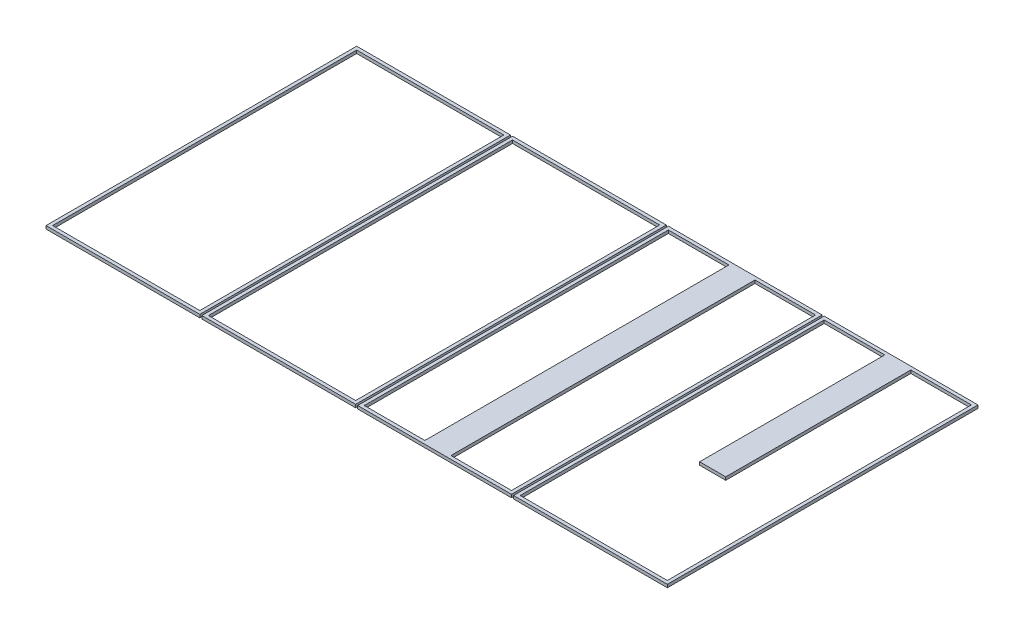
ISO-10303-21;
HEADER;
FILE_DESCRIPTION(('STEP AP214'),'2;1');
FILE_NAME('part.step','',(''),(''),'','','');
FILE_SCHEMA(('AUTOMOTIVE_DESIGN { 1 0 10303 214 1 1 1 1 }'));
ENDSEC;
DATA;
#1=APPLICATION_CONTEXT('core data for automotive mechanical design processes');
#2=APPLICATION_PROTOCOL_DEFINITION('international standard','automotive_design',2000,#1);
#3=PRODUCT_CONTEXT('',#1,'mechanical');
#4=PRODUCT('Part','Part','',(#3));
#5=PRODUCT_RELATED_PRODUCT_CATEGORY('part','',(#4));
#6=PRODUCT_DEFINITION_FORMATION('','',#4);
#7=PRODUCT_DEFINITION_CONTEXT('part definition',#1,'design');
#8=PRODUCT_DEFINITION('design','',#6,#7);
#9=PRODUCT_DEFINITION_SHAPE('','',#8);
#10=(LENGTH_UNIT() NAMED_UNIT(*) SI_UNIT(.MILLI.,.METRE.));
#11=(NAMED_UNIT(*) PLANE_ANGLE_UNIT() SI_UNIT($,.RADIAN.));
#12=(NAMED_UNIT(*) SI_UNIT($,.STERADIAN.) SOLID_ANGLE_UNIT());
#13=UNCERTAINTY_MEASURE_WITH_UNIT(LENGTH_MEASURE(1.E-05),#10,'distance_accuracy_value','');
#14=(GEOMETRIC_REPRESENTATION_CONTEXT(3) GLOBAL_UNCERTAINTY_ASSIGNED_CONTEXT((#13)) GLOBAL_UNIT_ASSIGNED_CONTEXT((#10,
#11,#12)) REPRESENTATION_CONTEXT('',''));
#15=CARTESIAN_POINT('',(0.,0.,0.));
#16=DIRECTION('',(0.,0.,1.));
#17=DIRECTION('',(1.,0.,0.));
#18=AXIS2_PLACEMENT_3D('',#15,#16,#17);
#19=CARTESIAN_POINT('',(1237.,12.,-13.));
#20=DIRECTION('',(0.,0.,-1.));
#21=DIRECTION('',(-1.,0.,0.));
#22=AXIS2_PLACEMENT_3D('',#19,#20,#21);
#23=PLANE('',#22);
#24=DIRECTION('',(1.,0.,0.));
#25=VECTOR('',#24,1.);
#26=CARTESIAN_POINT('',(1237.,12.,-13.));
#27=LINE('',#26,#25);
#28=CARTESIAN_POINT('',(1237.,12.,-13.));
#29=VERTEX_POINT('',#28);
#30=CARTESIAN_POINT('',(1474.8,12.,-13.));
#31=VERTEX_POINT('',#30);
#32=EDGE_CURVE('E137',#29,#31,#27,.T.);
#33=ORIENTED_EDGE('',*,*,#32,.T.);
#34=DIRECTION('',(0.,-1.,0.));
#35=VECTOR('',#34,1.);
#36=CARTESIAN_POINT('',(1474.8,12.,-13.));
#37=LINE('',#36,#35);
#38=CARTESIAN_POINT('',(1474.8,0.,-13.));
#39=VERTEX_POINT('',#38);
#40=EDGE_CURVE('E144',#31,#39,#37,.T.);
#41=ORIENTED_EDGE('',*,*,#40,.T.);
#42=DIRECTION('',(1.,0.,0.));
#43=VECTOR('',#42,1.);
#44=CARTESIAN_POINT('',(1237.,0.,-13.));
#45=LINE('',#44,#43);
#46=CARTESIAN_POINT('',(1237.,0.,-13.));
#47=VERTEX_POINT('',#46);
#48=EDGE_CURVE('E168',#47,#39,#45,.T.);
#49=ORIENTED_EDGE('',*,*,#48,.F.);
#50=DIRECTION('',(0.,-1.,0.));
#51=VECTOR('',#50,1.);
#52=CARTESIAN_POINT('',(1237.,12.,-13.));
#53=LINE('',#52,#51);
#54=EDGE_CURVE('E152',#29,#47,#53,.T.);
#55=ORIENTED_EDGE('',*,*,#54,.F.);
#56=EDGE_LOOP('',(#33,#41,#49,#55));
#57=FACE_BOUND('',#56,.T.);
#58=ADVANCED_FACE('F43',(#57),#23,.T.);
#59=CARTESIAN_POINT('',(1577.2,0.,-13.));
#60=VERTEX_POINT('',#59);
#61=CARTESIAN_POINT('',(1815.,0.,-13.));
#62=VERTEX_POINT('',#61);
#63=EDGE_CURVE('E167',#60,#62,#45,.T.);
#64=ORIENTED_EDGE('',*,*,#63,.F.);
#65=DIRECTION('',(0.,-1.,0.));
#66=VECTOR('',#65,1.);
#67=CARTESIAN_POINT('',(1577.2,12.,-12.9999999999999));
#68=LINE('',#67,#66);
#69=CARTESIAN_POINT('',(1577.2,12.,-12.9999999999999));
#70=VERTEX_POINT('',#69);
#71=EDGE_CURVE('E148',#70,#60,#68,.T.);
#72=ORIENTED_EDGE('',*,*,#71,.F.);
#73=CARTESIAN_POINT('',(1815.,12.,-13.));
#74=VERTEX_POINT('',#73);
#75=EDGE_CURVE('E154',#70,#74,#27,.T.);
#76=ORIENTED_EDGE('',*,*,#75,.T.);
#77=DIRECTION('',(0.,-1.,0.));
#78=VECTOR('',#77,1.);
#79=CARTESIAN_POINT('',(1815.,12.,-13.));
#80=LINE('',#79,#78);
#81=EDGE_CURVE('E180',#74,#62,#80,.T.);
#82=ORIENTED_EDGE('',*,*,#81,.T.);
#83=EDGE_LOOP('',(#64,#72,#76,#82));
#84=FACE_BOUND('',#83,.T.);
#85=ADVANCED_FACE('F235',(#84),#23,.T.);
#86=CARTESIAN_POINT('',(1237.,12.,-1207.));
#87=DIRECTION('',(0.,0.,1.));
#88=DIRECTION('',(1.,0.,0.));
#89=AXIS2_PLACEMENT_3D('',#86,#87,#88);
#90=PLANE('',#89);
#91=DIRECTION('',(-1.,0.,0.));
#92=VECTOR('',#91,1.);
#93=CARTESIAN_POINT('',(1237.,0.,-1207.));
#94=LINE('',#93,#92);
#95=CARTESIAN_POINT('',(1474.8,0.,-1207.));
#96=VERTEX_POINT('',#95);
#97=CARTESIAN_POINT('',(1237.,0.,-1207.));
#98=VERTEX_POINT('',#97);
#99=EDGE_CURVE('E173',#96,#98,#94,.T.);
#100=ORIENTED_EDGE('',*,*,#99,.F.);
#101=DIRECTION('',(0.,-1.,0.));
#102=VECTOR('',#101,1.);
#103=CARTESIAN_POINT('',(1474.8,12.,-1207.));
#104=LINE('',#103,#102);
#105=CARTESIAN_POINT('',(1474.8,12.,-1207.));
#106=VERTEX_POINT('',#105);
#107=EDGE_CURVE('E296',#106,#96,#104,.T.);
#108=ORIENTED_EDGE('',*,*,#107,.F.);
#109=DIRECTION('',(-1.,0.,0.));
#110=VECTOR('',#109,1.);
#111=CARTESIAN_POINT('',(1237.,12.,-1207.));
#112=LINE('',#111,#110);
#113=CARTESIAN_POINT('',(1237.,12.,-1207.));
#114=VERTEX_POINT('',#113);
#115=EDGE_CURVE('E138',#106,#114,#112,.T.);
#116=ORIENTED_EDGE('',*,*,#115,.T.);
#117=DIRECTION('',(0.,-1.,0.));
#118=VECTOR('',#117,1.);
#119=CARTESIAN_POINT('',(1237.,12.,-1207.));
#120=LINE('',#119,#118);
#121=EDGE_CURVE('E164',#114,#98,#120,.T.);
#122=ORIENTED_EDGE('',*,*,#121,.T.);
#123=EDGE_LOOP('',(#100,#108,#116,#122));
#124=FACE_BOUND('',#123,.T.);
#125=ADVANCED_FACE('F240',(#124),#90,.T.);
#126=CARTESIAN_POINT('',(1815.,12.,-1207.));
#127=VERTEX_POINT('',#126);
#128=CARTESIAN_POINT('',(1577.2,12.,-1207.));
#129=VERTEX_POINT('',#128);
#130=EDGE_CURVE('E161',#127,#129,#112,.T.);
#131=ORIENTED_EDGE('',*,*,#130,.T.);
#132=DIRECTION('',(0.,-1.,0.));
#133=VECTOR('',#132,1.);
#134=CARTESIAN_POINT('',(1577.2,12.,-1207.));
#135=LINE('',#134,#133);
#136=CARTESIAN_POINT('',(1577.2,0.,-1207.));
#137=VERTEX_POINT('',#136);
#138=EDGE_CURVE('E299',#129,#137,#135,.T.);
#139=ORIENTED_EDGE('',*,*,#138,.T.);
#140=CARTESIAN_POINT('',(1815.,0.,-1207.));
#141=VERTEX_POINT('',#140);
#142=EDGE_CURVE('E174',#141,#137,#94,.T.);
#143=ORIENTED_EDGE('',*,*,#142,.F.);
#144=DIRECTION('',(0.,-1.,0.));
#145=VECTOR('',#144,1.);
#146=CARTESIAN_POINT('',(1815.,12.,-1207.));
#147=LINE('',#146,#145);
#148=EDGE_CURVE('E178',#127,#141,#147,.T.);
#149=ORIENTED_EDGE('',*,*,#148,.F.);
#150=EDGE_LOOP('',(#131,#139,#143,#149));
#151=FACE_BOUND('',#150,.T.);
#152=ADVANCED_FACE('F252',(#151),#90,.T.);
#153=CARTESIAN_POINT('',(0.,12.,0.));
#154=DIRECTION('',(0.,1.,0.));
#155=DIRECTION('',(0.,0.,1.));
#156=AXIS2_PLACEMENT_3D('',#153,#154,#155);
#157=PLANE('',#156);
#158=ORIENTED_EDGE('',*,*,#75,.F.);
#159=DIRECTION('',(0.,0.,-1.));
#160=VECTOR('',#159,1.);
#161=CARTESIAN_POINT('',(1577.2,12.,-1207.));
#162=LINE('',#161,#160);
#163=EDGE_CURVE('E141',#70,#129,#162,.T.);
#164=ORIENTED_EDGE('',*,*,#163,.T.);
#165=ORIENTED_EDGE('',*,*,#130,.F.);
#166=DIRECTION('',(0.,0.,-1.));
#167=VECTOR('',#166,1.);
#168=CARTESIAN_POINT('',(1815.,12.,-13.));
#169=LINE('',#168,#167);
#170=EDGE_CURVE('E153',#74,#127,#169,.T.);
#171=ORIENTED_EDGE('',*,*,#170,.F.);
#172=EDGE_LOOP('',(#158,#164,#165,#171));
#173=FACE_BOUND('',#172,.T.);
#174=DIRECTION('',(1.,0.,0.));
#175=VECTOR('',#174,1.);
#176=CARTESIAN_POINT('',(1224.,12.,0.));
#177=LINE('',#176,#175);
#178=CARTESIAN_POINT('',(1224.,12.,0.));
#179=VERTEX_POINT('',#178);
#180=CARTESIAN_POINT('',(1828.,12.,0.));
#181=VERTEX_POINT('',#180);
#182=EDGE_CURVE('E185',#179,#181,#177,.T.);
#183=ORIENTED_EDGE('',*,*,#182,.T.);
#184=DIRECTION('',(0.,0.,-1.));
#185=VECTOR('',#184,1.);
#186=CARTESIAN_POINT('',(1828.,12.,0.));
#187=LINE('',#186,#185);
#188=CARTESIAN_POINT('',(1828.,12.,-1220.));
#189=VERTEX_POINT('',#188);
#190=EDGE_CURVE('E187',#181,#189,#187,.T.);
#191=ORIENTED_EDGE('',*,*,#190,.T.);
#192=DIRECTION('',(-1.,0.,0.));
#193=VECTOR('',#192,1.);
#194=CARTESIAN_POINT('',(1224.,12.,-1220.));
#195=LINE('',#194,#193);
#196=CARTESIAN_POINT('',(1224.,12.,-1220.));
#197=VERTEX_POINT('',#196);
#198=EDGE_CURVE('E190',#189,#197,#195,.T.);
#199=ORIENTED_EDGE('',*,*,#198,.T.);
#200=DIRECTION('',(0.,0.,1.));
#201=VECTOR('',#200,1.);
#202=CARTESIAN_POINT('',(1224.,12.,0.));
#203=LINE('',#202,#201);
#204=EDGE_CURVE('E192',#197,#179,#203,.T.);
#205=ORIENTED_EDGE('',*,*,#204,.T.);
#206=EDGE_LOOP('',(#183,#191,#199,#205));
#207=FACE_BOUND('',#206,.T.);
#208=ORIENTED_EDGE('',*,*,#32,.F.);
#209=DIRECTION('',(0.,0.,1.));
#210=VECTOR('',#209,1.);
#211=CARTESIAN_POINT('',(1237.,12.,-13.));
#212=LINE('',#211,#210);
#213=EDGE_CURVE('E158',#114,#29,#212,.T.);
#214=ORIENTED_EDGE('',*,*,#213,.F.);
#215=ORIENTED_EDGE('',*,*,#115,.F.);
#216=DIRECTION('',(0.,0.,1.));
#217=VECTOR('',#216,1.);
#218=CARTESIAN_POINT('',(1474.8,12.,-1207.));
#219=LINE('',#218,#217);
#220=EDGE_CURVE('E132',#106,#31,#219,.T.);
#221=ORIENTED_EDGE('',*,*,#220,.T.);
#222=EDGE_LOOP('',(#208,#214,#215,#221));
#223=FACE_BOUND('',#222,.T.);
#224=ADVANCED_FACE('F134',(#173,#207,#223),#157,.T.);
#225=CARTESIAN_POINT('',(0.,0.,0.));
#226=DIRECTION('',(0.,1.,0.));
#227=DIRECTION('',(0.,0.,1.));
#228=AXIS2_PLACEMENT_3D('',#225,#226,#227);
#229=PLANE('',#228);
#230=DIRECTION('',(0.,0.,-1.));
#231=VECTOR('',#230,1.);
#232=CARTESIAN_POINT('',(1577.2,0.,-1207.));
#233=LINE('',#232,#231);
#234=EDGE_CURVE('E58',#60,#137,#233,.T.);
#235=ORIENTED_EDGE('',*,*,#234,.F.);
#236=ORIENTED_EDGE('',*,*,#63,.T.);
#237=DIRECTION('',(0.,0.,-1.));
#238=VECTOR('',#237,1.);
#239=CARTESIAN_POINT('',(1815.,0.,-13.));
#240=LINE('',#239,#238);
#241=EDGE_CURVE('E170',#62,#141,#240,.T.);
#242=ORIENTED_EDGE('',*,*,#241,.T.);
#243=ORIENTED_EDGE('',*,*,#142,.T.);
#244=EDGE_LOOP('',(#235,#236,#242,#243));
#245=FACE_BOUND('',#244,.T.);
#246=DIRECTION('',(1.,0.,0.));
#247=VECTOR('',#246,1.);
#248=CARTESIAN_POINT('',(1815.,0.,0.));
#249=LINE('',#248,#247);
#250=CARTESIAN_POINT('',(1224.,0.,0.));
#251=VERTEX_POINT('',#250);
#252=CARTESIAN_POINT('',(1828.,0.,0.));
#253=VERTEX_POINT('',#252);
#254=EDGE_CURVE('E184',#251,#253,#249,.T.);
#255=ORIENTED_EDGE('',*,*,#254,.F.);
#256=DIRECTION('',(0.,0.,1.));
#257=VECTOR('',#256,1.);
#258=CARTESIAN_POINT('',(1224.,0.,0.));
#259=LINE('',#258,#257);
#260=CARTESIAN_POINT('',(1224.,0.,-1220.));
#261=VERTEX_POINT('',#260);
#262=EDGE_CURVE('E188',#261,#251,#259,.T.);
#263=ORIENTED_EDGE('',*,*,#262,.F.);
#264=DIRECTION('',(-1.,0.,0.));
#265=VECTOR('',#264,1.);
#266=CARTESIAN_POINT('',(1224.,0.,-1220.));
#267=LINE('',#266,#265);
#268=CARTESIAN_POINT('',(1828.,0.,-1220.));
#269=VERTEX_POINT('',#268);
#270=EDGE_CURVE('E198',#269,#261,#267,.T.);
#271=ORIENTED_EDGE('',*,*,#270,.F.);
#272=DIRECTION('',(0.,0.,-1.));
#273=VECTOR('',#272,1.);
#274=CARTESIAN_POINT('',(1828.,0.,0.));
#275=LINE('',#274,#273);
#276=EDGE_CURVE('E196',#253,#269,#275,.T.);
#277=ORIENTED_EDGE('',*,*,#276,.F.);
#278=EDGE_LOOP('',(#255,#263,#271,#277));
#279=FACE_BOUND('',#278,.T.);
#280=DIRECTION('',(0.,0.,1.));
#281=VECTOR('',#280,1.);
#282=CARTESIAN_POINT('',(1237.,0.,-13.));
#283=LINE('',#282,#281);
#284=EDGE_CURVE('E147',#98,#47,#283,.T.);
#285=ORIENTED_EDGE('',*,*,#284,.T.);
#286=ORIENTED_EDGE('',*,*,#48,.T.);
#287=DIRECTION('',(0.,0.,1.));
#288=VECTOR('',#287,1.);
#289=CARTESIAN_POINT('',(1474.8,0.,-1207.));
#290=LINE('',#289,#288);
#291=EDGE_CURVE('E66',#96,#39,#290,.T.);
#292=ORIENTED_EDGE('',*,*,#291,.F.);
#293=ORIENTED_EDGE('',*,*,#99,.T.);
#294=EDGE_LOOP('',(#285,#286,#292,#293));
#295=FACE_BOUND('',#294,.T.);
#296=ADVANCED_FACE('F218',(#245,#279,#295),#229,.F.);
#297=CARTESIAN_POINT('',(1815.,12.,0.));
#298=DIRECTION('',(0.,0.,-1.));
#299=DIRECTION('',(-1.,0.,0.));
#300=AXIS2_PLACEMENT_3D('',#297,#298,#299);
#301=PLANE('',#300);
#302=ORIENTED_EDGE('',*,*,#254,.T.);
#303=DIRECTION('',(0.,-1.,0.));
#304=VECTOR('',#303,1.);
#305=CARTESIAN_POINT('',(1828.,12.,0.));
#306=LINE('',#305,#304);
#307=EDGE_CURVE('E12',#181,#253,#306,.T.);
#308=ORIENTED_EDGE('',*,*,#307,.F.);
#309=ORIENTED_EDGE('',*,*,#182,.F.);
#310=DIRECTION('',(0.,-1.,0.));
#311=VECTOR('',#310,1.);
#312=CARTESIAN_POINT('',(1224.,12.,0.));
#313=LINE('',#312,#311);
#314=EDGE_CURVE('E194',#179,#251,#313,.T.);
#315=ORIENTED_EDGE('',*,*,#314,.T.);
#316=EDGE_LOOP('',(#302,#308,#309,#315));
#317=FACE_BOUND('',#316,.T.);
#318=ADVANCED_FACE('F45',(#317),#301,.F.);
#319=CARTESIAN_POINT('',(1828.,12.,0.));
#320=DIRECTION('',(-1.,0.,0.));
#321=DIRECTION('',(0.,0.,1.));
#322=AXIS2_PLACEMENT_3D('',#319,#320,#321);
#323=PLANE('',#322);
#324=ORIENTED_EDGE('',*,*,#276,.T.);
#325=DIRECTION('',(0.,-1.,0.));
#326=VECTOR('',#325,1.);
#327=CARTESIAN_POINT('',(1828.,12.,-1220.));
#328=LINE('',#327,#326);
#329=EDGE_CURVE('E51',#189,#269,#328,.T.);
#330=ORIENTED_EDGE('',*,*,#329,.F.);
#331=ORIENTED_EDGE('',*,*,#190,.F.);
#332=ORIENTED_EDGE('',*,*,#307,.T.);
#333=EDGE_LOOP('',(#324,#330,#331,#332));
#334=FACE_BOUND('',#333,.T.);
#335=ADVANCED_FACE('F227',(#334),#323,.F.);
#336=CARTESIAN_POINT('',(1224.,12.,-1220.));
#337=DIRECTION('',(0.,0.,1.));
#338=DIRECTION('',(1.,0.,0.));
#339=AXIS2_PLACEMENT_3D('',#336,#337,#338);
#340=PLANE('',#339);
#341=ORIENTED_EDGE('',*,*,#270,.T.);
#342=DIRECTION('',(0.,-1.,0.));
#343=VECTOR('',#342,1.);
#344=CARTESIAN_POINT('',(1224.,12.,-1220.));
#345=LINE('',#344,#343);
#346=EDGE_CURVE('E204',#197,#261,#345,.T.);
#347=ORIENTED_EDGE('',*,*,#346,.F.);
#348=ORIENTED_EDGE('',*,*,#198,.F.);
#349=ORIENTED_EDGE('',*,*,#329,.T.);
#350=EDGE_LOOP('',(#341,#347,#348,#349));
#351=FACE_BOUND('',#350,.T.);
#352=ADVANCED_FACE('F211',(#351),#340,.F.);
#353=CARTESIAN_POINT('',(1224.,12.,0.));
#354=DIRECTION('',(1.,0.,0.));
#355=DIRECTION('',(0.,0.,-1.));
#356=AXIS2_PLACEMENT_3D('',#353,#354,#355);
#357=PLANE('',#356);
#358=ORIENTED_EDGE('',*,*,#262,.T.);
#359=ORIENTED_EDGE('',*,*,#314,.F.);
#360=ORIENTED_EDGE('',*,*,#204,.F.);
#361=ORIENTED_EDGE('',*,*,#346,.T.);
#362=EDGE_LOOP('',(#358,#359,#360,#361));
#363=FACE_BOUND('',#362,.T.);
#364=ADVANCED_FACE('F221',(#363),#357,.F.);
#365=CARTESIAN_POINT('',(1237.,12.,-13.));
#366=DIRECTION('',(1.,0.,0.));
#367=DIRECTION('',(0.,0.,-1.));
#368=AXIS2_PLACEMENT_3D('',#365,#366,#367);
#369=PLANE('',#368);
#370=ORIENTED_EDGE('',*,*,#284,.F.);
#371=ORIENTED_EDGE('',*,*,#121,.F.);
#372=ORIENTED_EDGE('',*,*,#213,.T.);
#373=ORIENTED_EDGE('',*,*,#54,.T.);
#374=EDGE_LOOP('',(#370,#371,#372,#373));
#375=FACE_BOUND('',#374,.T.);
#376=ADVANCED_FACE('F246',(#375),#369,.T.);
#377=CARTESIAN_POINT('',(1815.,12.,-13.));
#378=DIRECTION('',(-1.,0.,0.));
#379=DIRECTION('',(0.,0.,1.));
#380=AXIS2_PLACEMENT_3D('',#377,#378,#379);
#381=PLANE('',#380);
#382=ORIENTED_EDGE('',*,*,#241,.F.);
#383=ORIENTED_EDGE('',*,*,#81,.F.);
#384=ORIENTED_EDGE('',*,*,#170,.T.);
#385=ORIENTED_EDGE('',*,*,#148,.T.);
#386=EDGE_LOOP('',(#382,#383,#384,#385));
#387=FACE_BOUND('',#386,.T.);
#388=ADVANCED_FACE('F244',(#387),#381,.T.);
#389=CARTESIAN_POINT('',(1474.8,12.,-1207.));
#390=DIRECTION('',(1.,0.,0.));
#391=DIRECTION('',(0.,0.,-1.));
#392=AXIS2_PLACEMENT_3D('',#389,#390,#391);
#393=PLANE('',#392);
#394=ORIENTED_EDGE('',*,*,#291,.T.);
#395=ORIENTED_EDGE('',*,*,#40,.F.);
#396=ORIENTED_EDGE('',*,*,#220,.F.);
#397=ORIENTED_EDGE('',*,*,#107,.T.);
#398=EDGE_LOOP('',(#394,#395,#396,#397));
#399=FACE_BOUND('',#398,.T.);
#400=ADVANCED_FACE('F145',(#399),#393,.F.);
#401=CARTESIAN_POINT('',(1577.2,12.,-1207.));
#402=DIRECTION('',(-1.,0.,0.));
#403=DIRECTION('',(0.,0.,1.));
#404=AXIS2_PLACEMENT_3D('',#401,#402,#403);
#405=PLANE('',#404);
#406=ORIENTED_EDGE('',*,*,#234,.T.);
#407=ORIENTED_EDGE('',*,*,#138,.F.);
#408=ORIENTED_EDGE('',*,*,#163,.F.);
#409=ORIENTED_EDGE('',*,*,#71,.T.);
#410=EDGE_LOOP('',(#406,#407,#408,#409));
#411=FACE_BOUND('',#410,.T.);
#412=ADVANCED_FACE('F278',(#411),#405,.F.);
#413=CLOSED_SHELL('',(#58,#85,#125,#152,#224,#296,#318,#335,#352,#364,#376,#388,#400,#412));
#414=MANIFOLD_SOLID_BREP('B2',#413);
#415=CARTESIAN_POINT('',(0.,12.,0.));
#416=DIRECTION('',(0.,1.,0.));
#417=DIRECTION('',(0.,0.,1.));
#418=AXIS2_PLACEMENT_3D('',#415,#416,#417);
#419=PLANE('',#418);
#420=DIRECTION('',(1.,0.,0.));
#421=VECTOR('',#420,1.);
#422=CARTESIAN_POINT('',(612.,12.,0.));
#423=LINE('',#422,#421);
#424=CARTESIAN_POINT('',(612.,12.,0.));
#425=VERTEX_POINT('',#424);
#426=CARTESIAN_POINT('',(1216.,12.,0.));
#427=VERTEX_POINT('',#426);
#428=EDGE_CURVE('E467',#425,#427,#423,.T.);
#429=ORIENTED_EDGE('',*,*,#428,.T.);
#430=DIRECTION('',(0.,0.,-1.));
#431=VECTOR('',#430,1.);
#432=CARTESIAN_POINT('',(1216.,12.,0.));
#433=LINE('',#432,#431);
#434=CARTESIAN_POINT('',(1216.,12.,-1220.));
#435=VERTEX_POINT('',#434);
#436=EDGE_CURVE('E469',#427,#435,#433,.T.);
#437=ORIENTED_EDGE('',*,*,#436,.T.);
#438=DIRECTION('',(-1.,0.,0.));
#439=VECTOR('',#438,1.);
#440=CARTESIAN_POINT('',(612.,12.,-1220.));
#441=LINE('',#440,#439);
#442=CARTESIAN_POINT('',(612.,12.,-1220.));
#443=VERTEX_POINT('',#442);
#444=EDGE_CURVE('E472',#435,#443,#441,.T.);
#445=ORIENTED_EDGE('',*,*,#444,.T.);
#446=DIRECTION('',(0.,0.,1.));
#447=VECTOR('',#446,1.);
#448=CARTESIAN_POINT('',(612.,12.,0.));
#449=LINE('',#448,#447);
#450=EDGE_CURVE('E474',#443,#425,#449,.T.);
#451=ORIENTED_EDGE('',*,*,#450,.T.);
#452=EDGE_LOOP('',(#429,#437,#445,#451));
#453=FACE_BOUND('',#452,.T.);
#454=DIRECTION('',(1.,0.,0.));
#455=VECTOR('',#454,1.);
#456=CARTESIAN_POINT('',(625.,12.,-13.));
#457=LINE('',#456,#455);
#458=CARTESIAN_POINT('',(625.,12.,-13.));
#459=VERTEX_POINT('',#458);
#460=CARTESIAN_POINT('',(1203.,12.,-13.));
#461=VERTEX_POINT('',#460);
#462=EDGE_CURVE('E439',#459,#461,#457,.T.);
#463=ORIENTED_EDGE('',*,*,#462,.F.);
#464=DIRECTION('',(0.,0.,1.));
#465=VECTOR('',#464,1.);
#466=CARTESIAN_POINT('',(625.,12.,-1207.));
#467=LINE('',#466,#465);
#468=CARTESIAN_POINT('',(625.,12.,-1207.));
#469=VERTEX_POINT('',#468);
#470=EDGE_CURVE('E431',#469,#459,#467,.T.);
#471=ORIENTED_EDGE('',*,*,#470,.F.);
#472=DIRECTION('',(-1.,0.,0.));
#473=VECTOR('',#472,1.);
#474=CARTESIAN_POINT('',(625.,12.,-1207.));
#475=LINE('',#474,#473);
#476=CARTESIAN_POINT('',(1203.,12.,-1207.));
#477=VERTEX_POINT('',#476);
#478=EDGE_CURVE('E453',#477,#469,#475,.T.);
#479=ORIENTED_EDGE('',*,*,#478,.F.);
#480=DIRECTION('',(0.,0.,-1.));
#481=VECTOR('',#480,1.);
#482=CARTESIAN_POINT('',(1203.,12.,-1207.));
#483=LINE('',#482,#481);
#484=EDGE_CURVE('E451',#461,#477,#483,.T.);
#485=ORIENTED_EDGE('',*,*,#484,.F.);
#486=EDGE_LOOP('',(#463,#471,#479,#485));
#487=FACE_BOUND('',#486,.T.);
#488=ADVANCED_FACE('F366',(#453,#487),#419,.T.);
#489=CARTESIAN_POINT('',(0.,0.,0.));
#490=DIRECTION('',(0.,1.,0.));
#491=DIRECTION('',(0.,0.,1.));
#492=AXIS2_PLACEMENT_3D('',#489,#490,#491);
#493=PLANE('',#492);
#494=DIRECTION('',(1.,0.,0.));
#495=VECTOR('',#494,1.);
#496=CARTESIAN_POINT('',(1203.,0.,0.));
#497=LINE('',#496,#495);
#498=CARTESIAN_POINT('',(612.,0.,0.));
#499=VERTEX_POINT('',#498);
#500=CARTESIAN_POINT('',(1216.,0.,0.));
#501=VERTEX_POINT('',#500);
#502=EDGE_CURVE('E447',#499,#501,#497,.T.);
#503=ORIENTED_EDGE('',*,*,#502,.F.);
#504=DIRECTION('',(0.,0.,1.));
#505=VECTOR('',#504,1.);
#506=CARTESIAN_POINT('',(612.,0.,0.));
#507=LINE('',#506,#505);
#508=CARTESIAN_POINT('',(612.,0.,-1220.));
#509=VERTEX_POINT('',#508);
#510=EDGE_CURVE('E470',#509,#499,#507,.T.);
#511=ORIENTED_EDGE('',*,*,#510,.F.);
#512=DIRECTION('',(-1.,0.,0.));
#513=VECTOR('',#512,1.);
#514=CARTESIAN_POINT('',(612.,0.,-1220.));
#515=LINE('',#514,#513);
#516=CARTESIAN_POINT('',(1216.,0.,-1220.));
#517=VERTEX_POINT('',#516);
#518=EDGE_CURVE('E480',#517,#509,#515,.T.);
#519=ORIENTED_EDGE('',*,*,#518,.F.);
#520=DIRECTION('',(0.,0.,-1.));
#521=VECTOR('',#520,1.);
#522=CARTESIAN_POINT('',(1216.,0.,0.));
#523=LINE('',#522,#521);
#524=EDGE_CURVE('E478',#501,#517,#523,.T.);
#525=ORIENTED_EDGE('',*,*,#524,.F.);
#526=EDGE_LOOP('',(#503,#511,#519,#525));
#527=FACE_BOUND('',#526,.T.);
#528=DIRECTION('',(0.,0.,1.));
#529=VECTOR('',#528,1.);
#530=CARTESIAN_POINT('',(625.,0.,-1207.));
#531=LINE('',#530,#529);
#532=CARTESIAN_POINT('',(625.,0.,-1207.));
#533=VERTEX_POINT('',#532);
#534=CARTESIAN_POINT('',(625.,0.,-13.));
#535=VERTEX_POINT('',#534);
#536=EDGE_CURVE('E389',#533,#535,#531,.T.);
#537=ORIENTED_EDGE('',*,*,#536,.T.);
#538=DIRECTION('',(1.,0.,0.));
#539=VECTOR('',#538,1.);
#540=CARTESIAN_POINT('',(625.,0.,-13.));
#541=LINE('',#540,#539);
#542=CARTESIAN_POINT('',(1203.,0.,-13.));
#543=VERTEX_POINT('',#542);
#544=EDGE_CURVE('E446',#535,#543,#541,.T.);
#545=ORIENTED_EDGE('',*,*,#544,.T.);
#546=DIRECTION('',(0.,0.,-1.));
#547=VECTOR('',#546,1.);
#548=CARTESIAN_POINT('',(1203.,0.,-1207.));
#549=LINE('',#548,#547);
#550=CARTESIAN_POINT('',(1203.,0.,-1207.));
#551=VERTEX_POINT('',#550);
#552=EDGE_CURVE('E459',#543,#551,#549,.T.);
#553=ORIENTED_EDGE('',*,*,#552,.T.);
#554=DIRECTION('',(-1.,0.,0.));
#555=VECTOR('',#554,1.);
#556=CARTESIAN_POINT('',(625.,0.,-1207.));
#557=LINE('',#556,#555);
#558=EDGE_CURVE('E440',#551,#533,#557,.T.);
#559=ORIENTED_EDGE('',*,*,#558,.T.);
#560=EDGE_LOOP('',(#537,#545,#553,#559));
#561=FACE_BOUND('',#560,.T.);
#562=ADVANCED_FACE('F500',(#527,#561),#493,.F.);
#563=CARTESIAN_POINT('',(1203.,12.,0.));
#564=DIRECTION('',(0.,0.,-1.));
#565=DIRECTION('',(-1.,0.,0.));
#566=AXIS2_PLACEMENT_3D('',#563,#564,#565);
#567=PLANE('',#566);
#568=ORIENTED_EDGE('',*,*,#502,.T.);
#569=DIRECTION('',(0.,-1.,0.));
#570=VECTOR('',#569,1.);
#571=CARTESIAN_POINT('',(1216.,12.,0.));
#572=LINE('',#571,#570);
#573=EDGE_CURVE('E41',#427,#501,#572,.T.);
#574=ORIENTED_EDGE('',*,*,#573,.F.);
#575=ORIENTED_EDGE('',*,*,#428,.F.);
#576=DIRECTION('',(0.,-1.,0.));
#577=VECTOR('',#576,1.);
#578=CARTESIAN_POINT('',(612.,12.,0.));
#579=LINE('',#578,#577);
#580=EDGE_CURVE('E476',#425,#499,#579,.T.);
#581=ORIENTED_EDGE('',*,*,#580,.T.);
#582=EDGE_LOOP('',(#568,#574,#575,#581));
#583=FACE_BOUND('',#582,.T.);
#584=ADVANCED_FACE('F368',(#583),#567,.F.);
#585=CARTESIAN_POINT('',(1216.,12.,0.));
#586=DIRECTION('',(-1.,0.,0.));
#587=DIRECTION('',(0.,0.,1.));
#588=AXIS2_PLACEMENT_3D('',#585,#586,#587);
#589=PLANE('',#588);
#590=ORIENTED_EDGE('',*,*,#524,.T.);
#591=DIRECTION('',(0.,-1.,0.));
#592=VECTOR('',#591,1.);
#593=CARTESIAN_POINT('',(1216.,12.,-1220.));
#594=LINE('',#593,#592);
#595=EDGE_CURVE('E374',#435,#517,#594,.T.);
#596=ORIENTED_EDGE('',*,*,#595,.F.);
#597=ORIENTED_EDGE('',*,*,#436,.F.);
#598=ORIENTED_EDGE('',*,*,#573,.T.);
#599=EDGE_LOOP('',(#590,#596,#597,#598));
#600=FACE_BOUND('',#599,.T.);
#601=ADVANCED_FACE('F510',(#600),#589,.F.);
#602=CARTESIAN_POINT('',(612.,12.,-1220.));
#603=DIRECTION('',(0.,0.,1.));
#604=DIRECTION('',(1.,0.,0.));
#605=AXIS2_PLACEMENT_3D('',#602,#603,#604);
#606=PLANE('',#605);
#607=ORIENTED_EDGE('',*,*,#518,.T.);
#608=DIRECTION('',(0.,-1.,0.));
#609=VECTOR('',#608,1.);
#610=CARTESIAN_POINT('',(612.,12.,-1220.));
#611=LINE('',#610,#609);
#612=EDGE_CURVE('E486',#443,#509,#611,.T.);
#613=ORIENTED_EDGE('',*,*,#612,.F.);
#614=ORIENTED_EDGE('',*,*,#444,.F.);
#615=ORIENTED_EDGE('',*,*,#595,.T.);
#616=EDGE_LOOP('',(#607,#613,#614,#615));
#617=FACE_BOUND('',#616,.T.);
#618=ADVANCED_FACE('F493',(#617),#606,.F.);
#619=CARTESIAN_POINT('',(612.,12.,0.));
#620=DIRECTION('',(1.,0.,0.));
#621=DIRECTION('',(0.,0.,-1.));
#622=AXIS2_PLACEMENT_3D('',#619,#620,#621);
#623=PLANE('',#622);
#624=ORIENTED_EDGE('',*,*,#510,.T.);
#625=ORIENTED_EDGE('',*,*,#580,.F.);
#626=ORIENTED_EDGE('',*,*,#450,.F.);
#627=ORIENTED_EDGE('',*,*,#612,.T.);
#628=EDGE_LOOP('',(#624,#625,#626,#627));
#629=FACE_BOUND('',#628,.T.);
#630=ADVANCED_FACE('F504',(#629),#623,.F.);
#631=CARTESIAN_POINT('',(625.,12.,-1207.));
#632=DIRECTION('',(1.,0.,0.));
#633=DIRECTION('',(0.,0.,-1.));
#634=AXIS2_PLACEMENT_3D('',#631,#632,#633);
#635=PLANE('',#634);
#636=ORIENTED_EDGE('',*,*,#536,.F.);
#637=DIRECTION('',(0.,-1.,0.));
#638=VECTOR('',#637,1.);
#639=CARTESIAN_POINT('',(625.,12.,-1207.));
#640=LINE('',#639,#638);
#641=EDGE_CURVE('E435',#469,#533,#640,.T.);
#642=ORIENTED_EDGE('',*,*,#641,.F.);
#643=ORIENTED_EDGE('',*,*,#470,.T.);
#644=DIRECTION('',(0.,-1.,0.));
#645=VECTOR('',#644,1.);
#646=CARTESIAN_POINT('',(625.,12.,-13.));
#647=LINE('',#646,#645);
#648=EDGE_CURVE('E434',#459,#535,#647,.T.);
#649=ORIENTED_EDGE('',*,*,#648,.T.);
#650=EDGE_LOOP('',(#636,#642,#643,#649));
#651=FACE_BOUND('',#650,.T.);
#652=ADVANCED_FACE('F433',(#651),#635,.T.);
#653=CARTESIAN_POINT('',(625.,12.,-13.));
#654=DIRECTION('',(0.,0.,-1.));
#655=DIRECTION('',(-1.,0.,0.));
#656=AXIS2_PLACEMENT_3D('',#653,#654,#655);
#657=PLANE('',#656);
#658=ORIENTED_EDGE('',*,*,#544,.F.);
#659=ORIENTED_EDGE('',*,*,#648,.F.);
#660=ORIENTED_EDGE('',*,*,#462,.T.);
#661=DIRECTION('',(0.,-1.,0.));
#662=VECTOR('',#661,1.);
#663=CARTESIAN_POINT('',(1203.,12.,-13.));
#664=LINE('',#663,#662);
#665=EDGE_CURVE('E448',#461,#543,#664,.T.);
#666=ORIENTED_EDGE('',*,*,#665,.T.);
#667=EDGE_LOOP('',(#658,#659,#660,#666));
#668=FACE_BOUND('',#667,.T.);
#669=ADVANCED_FACE('F443',(#668),#657,.T.);
#670=CARTESIAN_POINT('',(1203.,12.,-1207.));
#671=DIRECTION('',(-1.,0.,0.));
#672=DIRECTION('',(0.,0.,1.));
#673=AXIS2_PLACEMENT_3D('',#670,#671,#672);
#674=PLANE('',#673);
#675=ORIENTED_EDGE('',*,*,#552,.F.);
#676=ORIENTED_EDGE('',*,*,#665,.F.);
#677=ORIENTED_EDGE('',*,*,#484,.T.);
#678=DIRECTION('',(0.,-1.,0.));
#679=VECTOR('',#678,1.);
#680=CARTESIAN_POINT('',(1203.,12.,-1207.));
#681=LINE('',#680,#679);
#682=EDGE_CURVE('E381',#477,#551,#681,.T.);
#683=ORIENTED_EDGE('',*,*,#682,.T.);
#684=EDGE_LOOP('',(#675,#676,#677,#683));
#685=FACE_BOUND('',#684,.T.);
#686=ADVANCED_FACE('F533',(#685),#674,.T.);
#687=CARTESIAN_POINT('',(625.,12.,-1207.));
#688=DIRECTION('',(0.,0.,1.));
#689=DIRECTION('',(1.,0.,0.));
#690=AXIS2_PLACEMENT_3D('',#687,#688,#689);
#691=PLANE('',#690);
#692=ORIENTED_EDGE('',*,*,#558,.F.);
#693=ORIENTED_EDGE('',*,*,#682,.F.);
#694=ORIENTED_EDGE('',*,*,#478,.T.);
#695=ORIENTED_EDGE('',*,*,#641,.T.);
#696=EDGE_LOOP('',(#692,#693,#694,#695));
#697=FACE_BOUND('',#696,.T.);
#698=ADVANCED_FACE('F537',(#697),#691,.T.);
#699=CLOSED_SHELL('',(#488,#562,#584,#601,#618,#630,#652,#669,#686,#698));
#700=MANIFOLD_SOLID_BREP('B6',#699);
#701=CARTESIAN_POINT('',(1849.,12.,-1207.));
#702=DIRECTION('',(0.,0.,1.));
#703=DIRECTION('',(1.,0.,0.));
#704=AXIS2_PLACEMENT_3D('',#701,#702,#703);
#705=PLANE('',#704);
#706=DIRECTION('',(-1.,0.,0.));
#707=VECTOR('',#706,1.);
#708=CARTESIAN_POINT('',(1849.,0.,-1207.));
#709=LINE('',#708,#707);
#710=CARTESIAN_POINT('',(2086.8,0.,-1207.));
#711=VERTEX_POINT('',#710);
#712=CARTESIAN_POINT('',(1849.,0.,-1207.));
#713=VERTEX_POINT('',#712);
#714=EDGE_CURVE('E726',#711,#713,#709,.T.);
#715=ORIENTED_EDGE('',*,*,#714,.F.);
#716=DIRECTION('',(0.,-1.,0.));
#717=VECTOR('',#716,1.);
#718=CARTESIAN_POINT('',(2086.8,12.,-1207.));
#719=LINE('',#718,#717);
#720=CARTESIAN_POINT('',(2086.8,12.,-1207.));
#721=VERTEX_POINT('',#720);
#722=EDGE_CURVE('E816',#721,#711,#719,.T.);
#723=ORIENTED_EDGE('',*,*,#722,.F.);
#724=DIRECTION('',(-1.,0.,0.));
#725=VECTOR('',#724,1.);
#726=CARTESIAN_POINT('',(1849.,12.,-1207.));
#727=LINE('',#726,#725);
#728=CARTESIAN_POINT('',(1849.,12.,-1207.));
#729=VERTEX_POINT('',#728);
#730=EDGE_CURVE('E696',#721,#729,#727,.T.);
#731=ORIENTED_EDGE('',*,*,#730,.T.);
#732=DIRECTION('',(0.,-1.,0.));
#733=VECTOR('',#732,1.);
#734=CARTESIAN_POINT('',(1849.,12.,-1207.));
#735=LINE('',#734,#733);
#736=EDGE_CURVE('E719',#729,#713,#735,.T.);
#737=ORIENTED_EDGE('',*,*,#736,.T.);
#738=EDGE_LOOP('',(#715,#723,#731,#737));
#739=FACE_BOUND('',#738,.T.);
#740=ADVANCED_FACE('F590',(#739),#705,.T.);
#741=CARTESIAN_POINT('',(2427.,12.,-1207.));
#742=VERTEX_POINT('',#741);
#743=CARTESIAN_POINT('',(2189.2,12.,-1207.));
#744=VERTEX_POINT('',#743);
#745=EDGE_CURVE('E718',#742,#744,#727,.T.);
#746=ORIENTED_EDGE('',*,*,#745,.T.);
#747=DIRECTION('',(0.,-1.,0.));
#748=VECTOR('',#747,1.);
#749=CARTESIAN_POINT('',(2189.2,12.,-1207.));
#750=LINE('',#749,#748);
#751=CARTESIAN_POINT('',(2189.2,0.,-1207.));
#752=VERTEX_POINT('',#751);
#753=EDGE_CURVE('E707',#744,#752,#750,.T.);
#754=ORIENTED_EDGE('',*,*,#753,.T.);
#755=CARTESIAN_POINT('',(2427.,0.,-1207.));
#756=VERTEX_POINT('',#755);
#757=EDGE_CURVE('E714',#756,#752,#709,.T.);
#758=ORIENTED_EDGE('',*,*,#757,.F.);
#759=DIRECTION('',(0.,-1.,0.));
#760=VECTOR('',#759,1.);
#761=CARTESIAN_POINT('',(2427.,12.,-1207.));
#762=LINE('',#761,#760);
#763=EDGE_CURVE('E613',#742,#756,#762,.T.);
#764=ORIENTED_EDGE('',*,*,#763,.F.);
#765=EDGE_LOOP('',(#746,#754,#758,#764));
#766=FACE_BOUND('',#765,.T.);
#767=ADVANCED_FACE('F782',(#766),#705,.T.);
#768=CARTESIAN_POINT('',(0.,12.,0.));
#769=DIRECTION('',(0.,1.,0.));
#770=DIRECTION('',(0.,0.,1.));
#771=AXIS2_PLACEMENT_3D('',#768,#769,#770);
#772=PLANE('',#771);
#773=DIRECTION('',(-1.,0.,0.));
#774=VECTOR('',#773,1.);
#775=CARTESIAN_POINT('',(1836.,12.,-1220.));
#776=LINE('',#775,#774);
#777=CARTESIAN_POINT('',(2440.,12.,-1220.));
#778=VERTEX_POINT('',#777);
#779=CARTESIAN_POINT('',(1836.,12.,-1220.));
#780=VERTEX_POINT('',#779);
#781=EDGE_CURVE('E738',#778,#780,#776,.T.);
#782=ORIENTED_EDGE('',*,*,#781,.T.);
#783=DIRECTION('',(0.,0.,1.));
#784=VECTOR('',#783,1.);
#785=CARTESIAN_POINT('',(1836.,12.,0.));
#786=LINE('',#785,#784);
#787=CARTESIAN_POINT('',(1836.,12.,0.));
#788=VERTEX_POINT('',#787);
#789=EDGE_CURVE('E741',#780,#788,#786,.T.);
#790=ORIENTED_EDGE('',*,*,#789,.T.);
#791=DIRECTION('',(1.,0.,0.));
#792=VECTOR('',#791,1.);
#793=CARTESIAN_POINT('',(1836.,12.,0.));
#794=LINE('',#793,#792);
#795=CARTESIAN_POINT('',(2440.,12.,0.));
#796=VERTEX_POINT('',#795);
#797=EDGE_CURVE('E744',#788,#796,#794,.T.);
#798=ORIENTED_EDGE('',*,*,#797,.T.);
#799=DIRECTION('',(0.,0.,-1.));
#800=VECTOR('',#799,1.);
#801=CARTESIAN_POINT('',(2440.,12.,0.));
#802=LINE('',#801,#800);
#803=EDGE_CURVE('E746',#796,#778,#802,.T.);
#804=ORIENTED_EDGE('',*,*,#803,.T.);
#805=EDGE_LOOP('',(#782,#790,#798,#804));
#806=FACE_BOUND('',#805,.T.);
#807=DIRECTION('',(1.,0.,0.));
#808=VECTOR('',#807,1.);
#809=CARTESIAN_POINT('',(1849.,12.,-13.));
#810=LINE('',#809,#808);
#811=CARTESIAN_POINT('',(1849.,12.,-13.));
#812=VERTEX_POINT('',#811);
#813=CARTESIAN_POINT('',(2427.,12.,-13.));
#814=VERTEX_POINT('',#813);
#815=EDGE_CURVE('E713',#812,#814,#810,.T.);
#816=ORIENTED_EDGE('',*,*,#815,.F.);
#817=DIRECTION('',(0.,0.,1.));
#818=VECTOR('',#817,1.);
#819=CARTESIAN_POINT('',(1849.,12.,-1207.));
#820=LINE('',#819,#818);
#821=EDGE_CURVE('E711',#729,#812,#820,.T.);
#822=ORIENTED_EDGE('',*,*,#821,.F.);
#823=ORIENTED_EDGE('',*,*,#730,.F.);
#824=DIRECTION('',(0.,0.,1.));
#825=VECTOR('',#824,1.);
#826=CARTESIAN_POINT('',(2086.8,12.,-1207.));
#827=LINE('',#826,#825);
#828=CARTESIAN_POINT('',(2086.8,12.,-480.1));
#829=VERTEX_POINT('',#828);
#830=EDGE_CURVE('E690',#721,#829,#827,.T.);
#831=ORIENTED_EDGE('',*,*,#830,.T.);
#832=DIRECTION('',(1.,0.,0.));
#833=VECTOR('',#832,1.);
#834=CARTESIAN_POINT('',(2086.8,12.,-480.1));
#835=LINE('',#834,#833);
#836=CARTESIAN_POINT('',(2189.2,12.,-480.1));
#837=VERTEX_POINT('',#836);
#838=EDGE_CURVE('E680',#829,#837,#835,.T.);
#839=ORIENTED_EDGE('',*,*,#838,.T.);
#840=DIRECTION('',(0.,0.,-1.));
#841=VECTOR('',#840,1.);
#842=CARTESIAN_POINT('',(2189.2,12.,-1207.));
#843=LINE('',#842,#841);
#844=EDGE_CURVE('E689',#837,#744,#843,.T.);
#845=ORIENTED_EDGE('',*,*,#844,.T.);
#846=ORIENTED_EDGE('',*,*,#745,.F.);
#847=DIRECTION('',(0.,0.,-1.));
#848=VECTOR('',#847,1.);
#849=CARTESIAN_POINT('',(2427.,12.,-1207.));
#850=LINE('',#849,#848);
#851=EDGE_CURVE('E716',#814,#742,#850,.T.);
#852=ORIENTED_EDGE('',*,*,#851,.F.);
#853=EDGE_LOOP('',(#816,#822,#823,#831,#839,#845,#846,#852));
#854=FACE_BOUND('',#853,.T.);
#855=ADVANCED_FACE('F694',(#806,#854),#772,.T.);
#856=CARTESIAN_POINT('',(0.,0.,0.));
#857=DIRECTION('',(0.,1.,0.));
#858=DIRECTION('',(0.,0.,1.));
#859=AXIS2_PLACEMENT_3D('',#856,#857,#858);
#860=PLANE('',#859);
#861=DIRECTION('',(-1.,0.,0.));
#862=VECTOR('',#861,1.);
#863=CARTESIAN_POINT('',(1836.,0.,-1220.));
#864=LINE('',#863,#862);
#865=CARTESIAN_POINT('',(2440.,0.,-1220.));
#866=VERTEX_POINT('',#865);
#867=CARTESIAN_POINT('',(1836.,0.,-1220.));
#868=VERTEX_POINT('',#867);
#869=EDGE_CURVE('E737',#866,#868,#864,.T.);
#870=ORIENTED_EDGE('',*,*,#869,.F.);
#871=DIRECTION('',(0.,0.,-1.));
#872=VECTOR('',#871,1.);
#873=CARTESIAN_POINT('',(2440.,0.,0.));
#874=LINE('',#873,#872);
#875=CARTESIAN_POINT('',(2440.,0.,0.));
#876=VERTEX_POINT('',#875);
#877=EDGE_CURVE('E742',#876,#866,#874,.T.);
#878=ORIENTED_EDGE('',*,*,#877,.F.);
#879=DIRECTION('',(1.,0.,0.));
#880=VECTOR('',#879,1.);
#881=CARTESIAN_POINT('',(2427.,0.,0.));
#882=LINE('',#881,#880);
#883=CARTESIAN_POINT('',(1836.,0.,0.));
#884=VERTEX_POINT('',#883);
#885=EDGE_CURVE('E754',#884,#876,#882,.T.);
#886=ORIENTED_EDGE('',*,*,#885,.F.);
#887=DIRECTION('',(0.,0.,1.));
#888=VECTOR('',#887,1.);
#889=CARTESIAN_POINT('',(1836.,0.,0.));
#890=LINE('',#889,#888);
#891=EDGE_CURVE('E751',#868,#884,#890,.T.);
#892=ORIENTED_EDGE('',*,*,#891,.F.);
#893=EDGE_LOOP('',(#870,#878,#886,#892));
#894=FACE_BOUND('',#893,.T.);
#895=DIRECTION('',(0.,0.,1.));
#896=VECTOR('',#895,1.);
#897=CARTESIAN_POINT('',(1849.,0.,-1207.));
#898=LINE('',#897,#896);
#899=CARTESIAN_POINT('',(1849.,0.,-13.));
#900=VERTEX_POINT('',#899);
#901=EDGE_CURVE('E702',#713,#900,#898,.T.);
#902=ORIENTED_EDGE('',*,*,#901,.T.);
#903=DIRECTION('',(1.,0.,0.));
#904=VECTOR('',#903,1.);
#905=CARTESIAN_POINT('',(1849.,0.,-13.));
#906=LINE('',#905,#904);
#907=CARTESIAN_POINT('',(2427.,0.,-13.));
#908=VERTEX_POINT('',#907);
#909=EDGE_CURVE('E705',#900,#908,#906,.T.);
#910=ORIENTED_EDGE('',*,*,#909,.T.);
#911=DIRECTION('',(0.,0.,-1.));
#912=VECTOR('',#911,1.);
#913=CARTESIAN_POINT('',(2427.,0.,-1207.));
#914=LINE('',#913,#912);
#915=EDGE_CURVE('E723',#908,#756,#914,.T.);
#916=ORIENTED_EDGE('',*,*,#915,.T.);
#917=ORIENTED_EDGE('',*,*,#757,.T.);
#918=DIRECTION('',(0.,0.,-1.));
#919=VECTOR('',#918,1.);
#920=CARTESIAN_POINT('',(2189.2,0.,-1207.));
#921=LINE('',#920,#919);
#922=CARTESIAN_POINT('',(2189.2,0.,-480.1));
#923=VERTEX_POINT('',#922);
#924=EDGE_CURVE('E699',#923,#752,#921,.T.);
#925=ORIENTED_EDGE('',*,*,#924,.F.);
#926=DIRECTION('',(1.,0.,0.));
#927=VECTOR('',#926,1.);
#928=CARTESIAN_POINT('',(2086.8,0.,-480.1));
#929=LINE('',#928,#927);
#930=CARTESIAN_POINT('',(2086.8,0.,-480.1));
#931=VERTEX_POINT('',#930);
#932=EDGE_CURVE('E822',#931,#923,#929,.T.);
#933=ORIENTED_EDGE('',*,*,#932,.F.);
#934=DIRECTION('',(0.,0.,1.));
#935=VECTOR('',#934,1.);
#936=CARTESIAN_POINT('',(2086.8,0.,-1207.));
#937=LINE('',#936,#935);
#938=EDGE_CURVE('E605',#711,#931,#937,.T.);
#939=ORIENTED_EDGE('',*,*,#938,.F.);
#940=ORIENTED_EDGE('',*,*,#714,.T.);
#941=EDGE_LOOP('',(#902,#910,#916,#917,#925,#933,#939,#940));
#942=FACE_BOUND('',#941,.T.);
#943=ADVANCED_FACE('F772',(#894,#942),#860,.F.);
#944=CARTESIAN_POINT('',(1836.,12.,-1220.));
#945=DIRECTION('',(0.,0.,1.));
#946=DIRECTION('',(1.,0.,0.));
#947=AXIS2_PLACEMENT_3D('',#944,#945,#946);
#948=PLANE('',#947);
#949=ORIENTED_EDGE('',*,*,#869,.T.);
#950=DIRECTION('',(0.,-1.,0.));
#951=VECTOR('',#950,1.);
#952=CARTESIAN_POINT('',(1836.,12.,-1220.));
#953=LINE('',#952,#951);
#954=EDGE_CURVE('E364',#780,#868,#953,.T.);
#955=ORIENTED_EDGE('',*,*,#954,.F.);
#956=ORIENTED_EDGE('',*,*,#781,.F.);
#957=DIRECTION('',(0.,-1.,0.));
#958=VECTOR('',#957,1.);
#959=CARTESIAN_POINT('',(2440.,12.,-1220.));
#960=LINE('',#959,#958);
#961=EDGE_CURVE('E748',#778,#866,#960,.T.);
#962=ORIENTED_EDGE('',*,*,#961,.T.);
#963=EDGE_LOOP('',(#949,#955,#956,#962));
#964=FACE_BOUND('',#963,.T.);
#965=ADVANCED_FACE('F592',(#964),#948,.F.);
#966=CARTESIAN_POINT('',(1836.,12.,0.));
#967=DIRECTION('',(1.,0.,0.));
#968=DIRECTION('',(0.,0.,-1.));
#969=AXIS2_PLACEMENT_3D('',#966,#967,#968);
#970=PLANE('',#969);
#971=ORIENTED_EDGE('',*,*,#891,.T.);
#972=DIRECTION('',(0.,-1.,0.));
#973=VECTOR('',#972,1.);
#974=CARTESIAN_POINT('',(1836.,12.,0.));
#975=LINE('',#974,#973);
#976=EDGE_CURVE('E598',#788,#884,#975,.T.);
#977=ORIENTED_EDGE('',*,*,#976,.F.);
#978=ORIENTED_EDGE('',*,*,#789,.F.);
#979=ORIENTED_EDGE('',*,*,#954,.T.);
#980=EDGE_LOOP('',(#971,#977,#978,#979));
#981=FACE_BOUND('',#980,.T.);
#982=ADVANCED_FACE('F768',(#981),#970,.F.);
#983=CARTESIAN_POINT('',(2427.,12.,0.));
#984=DIRECTION('',(0.,0.,-1.));
#985=DIRECTION('',(-1.,0.,0.));
#986=AXIS2_PLACEMENT_3D('',#983,#984,#985);
#987=PLANE('',#986);
#988=ORIENTED_EDGE('',*,*,#885,.T.);
#989=DIRECTION('',(0.,-1.,0.));
#990=VECTOR('',#989,1.);
#991=CARTESIAN_POINT('',(2440.,12.,0.));
#992=LINE('',#991,#990);
#993=EDGE_CURVE('E759',#796,#876,#992,.T.);
#994=ORIENTED_EDGE('',*,*,#993,.F.);
#995=ORIENTED_EDGE('',*,*,#797,.F.);
#996=ORIENTED_EDGE('',*,*,#976,.T.);
#997=EDGE_LOOP('',(#988,#994,#995,#996));
#998=FACE_BOUND('',#997,.T.);
#999=ADVANCED_FACE('F765',(#998),#987,.F.);
#1000=CARTESIAN_POINT('',(2440.,12.,0.));
#1001=DIRECTION('',(-1.,0.,0.));
#1002=DIRECTION('',(0.,0.,1.));
#1003=AXIS2_PLACEMENT_3D('',#1000,#1001,#1002);
#1004=PLANE('',#1003);
#1005=ORIENTED_EDGE('',*,*,#877,.T.);
#1006=ORIENTED_EDGE('',*,*,#961,.F.);
#1007=ORIENTED_EDGE('',*,*,#803,.F.);
#1008=ORIENTED_EDGE('',*,*,#993,.T.);
#1009=EDGE_LOOP('',(#1005,#1006,#1007,#1008));
#1010=FACE_BOUND('',#1009,.T.);
#1011=ADVANCED_FACE('F776',(#1010),#1004,.F.);
#1012=CARTESIAN_POINT('',(1849.,12.,-1207.));
#1013=DIRECTION('',(1.,0.,0.));
#1014=DIRECTION('',(0.,0.,-1.));
#1015=AXIS2_PLACEMENT_3D('',#1012,#1013,#1014);
#1016=PLANE('',#1015);
#1017=ORIENTED_EDGE('',*,*,#901,.F.);
#1018=ORIENTED_EDGE('',*,*,#736,.F.);
#1019=ORIENTED_EDGE('',*,*,#821,.T.);
#1020=DIRECTION('',(0.,-1.,0.));
#1021=VECTOR('',#1020,1.);
#1022=CARTESIAN_POINT('',(1849.,12.,-13.));
#1023=LINE('',#1022,#1021);
#1024=EDGE_CURVE('E734',#812,#900,#1023,.T.);
#1025=ORIENTED_EDGE('',*,*,#1024,.T.);
#1026=EDGE_LOOP('',(#1017,#1018,#1019,#1025));
#1027=FACE_BOUND('',#1026,.T.);
#1028=ADVANCED_FACE('F805',(#1027),#1016,.T.);
#1029=CARTESIAN_POINT('',(1849.,12.,-13.));
#1030=DIRECTION('',(0.,0.,-1.));
#1031=DIRECTION('',(-1.,0.,0.));
#1032=AXIS2_PLACEMENT_3D('',#1029,#1030,#1031);
#1033=PLANE('',#1032);
#1034=ORIENTED_EDGE('',*,*,#909,.F.);
#1035=ORIENTED_EDGE('',*,*,#1024,.F.);
#1036=ORIENTED_EDGE('',*,*,#815,.T.);
#1037=DIRECTION('',(0.,-1.,0.));
#1038=VECTOR('',#1037,1.);
#1039=CARTESIAN_POINT('',(2427.,12.,-13.));
#1040=LINE('',#1039,#1038);
#1041=EDGE_CURVE('E732',#814,#908,#1040,.T.);
#1042=ORIENTED_EDGE('',*,*,#1041,.T.);
#1043=EDGE_LOOP('',(#1034,#1035,#1036,#1042));
#1044=FACE_BOUND('',#1043,.T.);
#1045=ADVANCED_FACE('F802',(#1044),#1033,.T.);
#1046=CARTESIAN_POINT('',(2427.,12.,-1207.));
#1047=DIRECTION('',(-1.,0.,0.));
#1048=DIRECTION('',(0.,0.,1.));
#1049=AXIS2_PLACEMENT_3D('',#1046,#1047,#1048);
#1050=PLANE('',#1049);
#1051=ORIENTED_EDGE('',*,*,#915,.F.);
#1052=ORIENTED_EDGE('',*,*,#1041,.F.);
#1053=ORIENTED_EDGE('',*,*,#851,.T.);
#1054=ORIENTED_EDGE('',*,*,#763,.T.);
#1055=EDGE_LOOP('',(#1051,#1052,#1053,#1054));
#1056=FACE_BOUND('',#1055,.T.);
#1057=ADVANCED_FACE('F799',(#1056),#1050,.T.);
#1058=CARTESIAN_POINT('',(2086.8,12.,-1207.));
#1059=DIRECTION('',(1.,0.,0.));
#1060=DIRECTION('',(0.,0.,-1.));
#1061=AXIS2_PLACEMENT_3D('',#1058,#1059,#1060);
#1062=PLANE('',#1061);
#1063=ORIENTED_EDGE('',*,*,#938,.T.);
#1064=DIRECTION('',(0.,-1.,0.));
#1065=VECTOR('',#1064,1.);
#1066=CARTESIAN_POINT('',(2086.8,12.,-480.1));
#1067=LINE('',#1066,#1065);
#1068=EDGE_CURVE('E684',#829,#931,#1067,.T.);
#1069=ORIENTED_EDGE('',*,*,#1068,.F.);
#1070=ORIENTED_EDGE('',*,*,#830,.F.);
#1071=ORIENTED_EDGE('',*,*,#722,.T.);
#1072=EDGE_LOOP('',(#1063,#1069,#1070,#1071));
#1073=FACE_BOUND('',#1072,.T.);
#1074=ADVANCED_FACE('F701',(#1073),#1062,.F.);
#1075=CARTESIAN_POINT('',(2086.8,12.,-480.1));
#1076=DIRECTION('',(0.,0.,-1.));
#1077=DIRECTION('',(-1.,0.,0.));
#1078=AXIS2_PLACEMENT_3D('',#1075,#1076,#1077);
#1079=PLANE('',#1078);
#1080=ORIENTED_EDGE('',*,*,#932,.T.);
#1081=DIRECTION('',(0.,-1.,0.));
#1082=VECTOR('',#1081,1.);
#1083=CARTESIAN_POINT('',(2189.2,12.,-480.1));
#1084=LINE('',#1083,#1082);
#1085=EDGE_CURVE('E686',#837,#923,#1084,.T.);
#1086=ORIENTED_EDGE('',*,*,#1085,.F.);
#1087=ORIENTED_EDGE('',*,*,#838,.F.);
#1088=ORIENTED_EDGE('',*,*,#1068,.T.);
#1089=EDGE_LOOP('',(#1080,#1086,#1087,#1088));
#1090=FACE_BOUND('',#1089,.T.);
#1091=ADVANCED_FACE('F682',(#1090),#1079,.F.);
#1092=CARTESIAN_POINT('',(2189.2,12.,-1207.));
#1093=DIRECTION('',(-1.,0.,0.));
#1094=DIRECTION('',(0.,0.,1.));
#1095=AXIS2_PLACEMENT_3D('',#1092,#1093,#1094);
#1096=PLANE('',#1095);
#1097=ORIENTED_EDGE('',*,*,#924,.T.);
#1098=ORIENTED_EDGE('',*,*,#753,.F.);
#1099=ORIENTED_EDGE('',*,*,#844,.F.);
#1100=ORIENTED_EDGE('',*,*,#1085,.T.);
#1101=EDGE_LOOP('',(#1097,#1098,#1099,#1100));
#1102=FACE_BOUND('',#1101,.T.);
#1103=ADVANCED_FACE('F826',(#1102),#1096,.F.);
#1104=CLOSED_SHELL('',(#740,#767,#855,#943,#965,#982,#999,#1011,#1028,#1045,#1057,#1074,#1091,#1103));
#1105=MANIFOLD_SOLID_BREP('B35',#1104);
#1106=CARTESIAN_POINT('',(0.,12.,0.));
#1107=DIRECTION('',(0.,1.,0.));
#1108=DIRECTION('',(0.,0.,1.));
#1109=AXIS2_PLACEMENT_3D('',#1106,#1107,#1108);
#1110=PLANE('',#1109);
#1111=DIRECTION('',(1.,0.,0.));
#1112=VECTOR('',#1111,1.);
#1113=CARTESIAN_POINT('',(0.,12.,0.));
#1114=LINE('',#1113,#1112);
#1115=CARTESIAN_POINT('',(0.,12.,0.));
#1116=VERTEX_POINT('',#1115);
#1117=CARTESIAN_POINT('',(604.,12.,0.));
#1118=VERTEX_POINT('',#1117);
#1119=EDGE_CURVE('E1005',#1116,#1118,#1114,.T.);
#1120=ORIENTED_EDGE('',*,*,#1119,.T.);
#1121=DIRECTION('',(0.,0.,-1.));
#1122=VECTOR('',#1121,1.);
#1123=CARTESIAN_POINT('',(604.,12.,0.));
#1124=LINE('',#1123,#1122);
#1125=CARTESIAN_POINT('',(604.,12.,-1220.));
#1126=VERTEX_POINT('',#1125);
#1127=EDGE_CURVE('E1007',#1118,#1126,#1124,.T.);
#1128=ORIENTED_EDGE('',*,*,#1127,.T.);
#1129=DIRECTION('',(-1.,0.,0.));
#1130=VECTOR('',#1129,1.);
#1131=CARTESIAN_POINT('',(0.,12.,-1220.));
#1132=LINE('',#1131,#1130);
#1133=CARTESIAN_POINT('',(0.,12.,-1220.));
#1134=VERTEX_POINT('',#1133);
#1135=EDGE_CURVE('E1010',#1126,#1134,#1132,.T.);
#1136=ORIENTED_EDGE('',*,*,#1135,.T.);
#1137=DIRECTION('',(0.,0.,1.));
#1138=VECTOR('',#1137,1.);
#1139=CARTESIAN_POINT('',(0.,12.,0.));
#1140=LINE('',#1139,#1138);
#1141=EDGE_CURVE('E1012',#1134,#1116,#1140,.T.);
#1142=ORIENTED_EDGE('',*,*,#1141,.T.);
#1143=EDGE_LOOP('',(#1120,#1128,#1136,#1142));
#1144=FACE_BOUND('',#1143,.T.);
#1145=DIRECTION('',(1.,0.,0.));
#1146=VECTOR('',#1145,1.);
#1147=CARTESIAN_POINT('',(12.9999999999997,12.,-12.9999999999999));
#1148=LINE('',#1147,#1146);
#1149=CARTESIAN_POINT('',(12.9999999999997,12.,-12.9999999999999));
#1150=VERTEX_POINT('',#1149);
#1151=CARTESIAN_POINT('',(591.,12.,-12.9999999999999));
#1152=VERTEX_POINT('',#1151);
#1153=EDGE_CURVE('E977',#1150,#1152,#1148,.T.);
#1154=ORIENTED_EDGE('',*,*,#1153,.F.);
#1155=DIRECTION('',(0.,0.,1.));
#1156=VECTOR('',#1155,1.);
#1157=CARTESIAN_POINT('',(12.9999999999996,12.,-1207.));
#1158=LINE('',#1157,#1156);
#1159=CARTESIAN_POINT('',(12.9999999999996,12.,-1207.));
#1160=VERTEX_POINT('',#1159);
#1161=EDGE_CURVE('E969',#1160,#1150,#1158,.T.);
#1162=ORIENTED_EDGE('',*,*,#1161,.F.);
#1163=DIRECTION('',(-1.,0.,0.));
#1164=VECTOR('',#1163,1.);
#1165=CARTESIAN_POINT('',(12.9999999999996,12.,-1207.));
#1166=LINE('',#1165,#1164);
#1167=CARTESIAN_POINT('',(591.,12.,-1207.));
#1168=VERTEX_POINT('',#1167);
#1169=EDGE_CURVE('E991',#1168,#1160,#1166,.T.);
#1170=ORIENTED_EDGE('',*,*,#1169,.F.);
#1171=DIRECTION('',(0.,0.,-1.));
#1172=VECTOR('',#1171,1.);
#1173=CARTESIAN_POINT('',(591.,12.,-1207.));
#1174=LINE('',#1173,#1172);
#1175=EDGE_CURVE('E989',#1152,#1168,#1174,.T.);
#1176=ORIENTED_EDGE('',*,*,#1175,.F.);
#1177=EDGE_LOOP('',(#1154,#1162,#1170,#1176));
#1178=FACE_BOUND('',#1177,.T.);
#1179=ADVANCED_FACE('F904',(#1144,#1178),#1110,.T.);
#1180=CARTESIAN_POINT('',(0.,0.,0.));
#1181=DIRECTION('',(0.,1.,0.));
#1182=DIRECTION('',(0.,0.,1.));
#1183=AXIS2_PLACEMENT_3D('',#1180,#1181,#1182);
#1184=PLANE('',#1183);
#1185=DIRECTION('',(1.,0.,0.));
#1186=VECTOR('',#1185,1.);
#1187=CARTESIAN_POINT('',(591.,0.,0.));
#1188=LINE('',#1187,#1186);
#1189=CARTESIAN_POINT('',(0.,0.,0.));
#1190=VERTEX_POINT('',#1189);
#1191=CARTESIAN_POINT('',(604.,0.,0.));
#1192=VERTEX_POINT('',#1191);
#1193=EDGE_CURVE('E985',#1190,#1192,#1188,.T.);
#1194=ORIENTED_EDGE('',*,*,#1193,.F.);
#1195=DIRECTION('',(0.,0.,1.));
#1196=VECTOR('',#1195,1.);
#1197=CARTESIAN_POINT('',(0.,0.,0.));
#1198=LINE('',#1197,#1196);
#1199=CARTESIAN_POINT('',(0.,0.,-1220.));
#1200=VERTEX_POINT('',#1199);
#1201=EDGE_CURVE('E1008',#1200,#1190,#1198,.T.);
#1202=ORIENTED_EDGE('',*,*,#1201,.F.);
#1203=DIRECTION('',(-1.,0.,0.));
#1204=VECTOR('',#1203,1.);
#1205=CARTESIAN_POINT('',(0.,0.,-1220.));
#1206=LINE('',#1205,#1204);
#1207=CARTESIAN_POINT('',(604.,0.,-1220.));
#1208=VERTEX_POINT('',#1207);
#1209=EDGE_CURVE('E1018',#1208,#1200,#1206,.T.);
#1210=ORIENTED_EDGE('',*,*,#1209,.F.);
#1211=DIRECTION('',(0.,0.,-1.));
#1212=VECTOR('',#1211,1.);
#1213=CARTESIAN_POINT('',(604.,0.,0.));
#1214=LINE('',#1213,#1212);
#1215=EDGE_CURVE('E1016',#1192,#1208,#1214,.T.);
#1216=ORIENTED_EDGE('',*,*,#1215,.F.);
#1217=EDGE_LOOP('',(#1194,#1202,#1210,#1216));
#1218=FACE_BOUND('',#1217,.T.);
#1219=DIRECTION('',(0.,0.,1.));
#1220=VECTOR('',#1219,1.);
#1221=CARTESIAN_POINT('',(12.9999999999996,0.,-1207.));
#1222=LINE('',#1221,#1220);
#1223=CARTESIAN_POINT('',(12.9999999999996,0.,-1207.));
#1224=VERTEX_POINT('',#1223);
#1225=CARTESIAN_POINT('',(12.9999999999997,0.,-12.9999999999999));
#1226=VERTEX_POINT('',#1225);
#1227=EDGE_CURVE('E927',#1224,#1226,#1222,.T.);
#1228=ORIENTED_EDGE('',*,*,#1227,.T.);
#1229=DIRECTION('',(1.,0.,0.));
#1230=VECTOR('',#1229,1.);
#1231=CARTESIAN_POINT('',(12.9999999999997,0.,-12.9999999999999));
#1232=LINE('',#1231,#1230);
#1233=CARTESIAN_POINT('',(591.,0.,-12.9999999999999));
#1234=VERTEX_POINT('',#1233);
#1235=EDGE_CURVE('E984',#1226,#1234,#1232,.T.);
#1236=ORIENTED_EDGE('',*,*,#1235,.T.);
#1237=DIRECTION('',(0.,0.,-1.));
#1238=VECTOR('',#1237,1.);
#1239=CARTESIAN_POINT('',(591.,0.,-1207.));
#1240=LINE('',#1239,#1238);
#1241=CARTESIAN_POINT('',(591.,0.,-1207.));
#1242=VERTEX_POINT('',#1241);
#1243=EDGE_CURVE('E997',#1234,#1242,#1240,.T.);
#1244=ORIENTED_EDGE('',*,*,#1243,.T.);
#1245=DIRECTION('',(-1.,0.,0.));
#1246=VECTOR('',#1245,1.);
#1247=CARTESIAN_POINT('',(12.9999999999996,0.,-1207.));
#1248=LINE('',#1247,#1246);
#1249=EDGE_CURVE('E978',#1242,#1224,#1248,.T.);
#1250=ORIENTED_EDGE('',*,*,#1249,.T.);
#1251=EDGE_LOOP('',(#1228,#1236,#1244,#1250));
#1252=FACE_BOUND('',#1251,.T.);
#1253=ADVANCED_FACE('F1038',(#1218,#1252),#1184,.F.);
#1254=CARTESIAN_POINT('',(591.,12.,0.));
#1255=DIRECTION('',(0.,0.,-1.));
#1256=DIRECTION('',(-1.,0.,0.));
#1257=AXIS2_PLACEMENT_3D('',#1254,#1255,#1256);
#1258=PLANE('',#1257);
#1259=ORIENTED_EDGE('',*,*,#1193,.T.);
#1260=DIRECTION('',(0.,-1.,0.));
#1261=VECTOR('',#1260,1.);
#1262=CARTESIAN_POINT('',(604.,12.,0.));
#1263=LINE('',#1262,#1261);
#1264=EDGE_CURVE('E588',#1118,#1192,#1263,.T.);
#1265=ORIENTED_EDGE('',*,*,#1264,.F.);
#1266=ORIENTED_EDGE('',*,*,#1119,.F.);
#1267=DIRECTION('',(0.,-1.,0.));
#1268=VECTOR('',#1267,1.);
#1269=CARTESIAN_POINT('',(0.,12.,0.));
#1270=LINE('',#1269,#1268);
#1271=EDGE_CURVE('E1014',#1116,#1190,#1270,.T.);
#1272=ORIENTED_EDGE('',*,*,#1271,.T.);
#1273=EDGE_LOOP('',(#1259,#1265,#1266,#1272));
#1274=FACE_BOUND('',#1273,.T.);
#1275=ADVANCED_FACE('F906',(#1274),#1258,.F.);
#1276=CARTESIAN_POINT('',(604.,12.,0.));
#1277=DIRECTION('',(-1.,0.,0.));
#1278=DIRECTION('',(0.,0.,1.));
#1279=AXIS2_PLACEMENT_3D('',#1276,#1277,#1278);
#1280=PLANE('',#1279);
#1281=ORIENTED_EDGE('',*,*,#1215,.T.);
#1282=DIRECTION('',(0.,-1.,0.));
#1283=VECTOR('',#1282,1.);
#1284=CARTESIAN_POINT('',(604.,12.,-1220.));
#1285=LINE('',#1284,#1283);
#1286=EDGE_CURVE('E912',#1126,#1208,#1285,.T.);
#1287=ORIENTED_EDGE('',*,*,#1286,.F.);
#1288=ORIENTED_EDGE('',*,*,#1127,.F.);
#1289=ORIENTED_EDGE('',*,*,#1264,.T.);
#1290=EDGE_LOOP('',(#1281,#1287,#1288,#1289));
#1291=FACE_BOUND('',#1290,.T.);
#1292=ADVANCED_FACE('F1048',(#1291),#1280,.F.);
#1293=CARTESIAN_POINT('',(0.,12.,-1220.));
#1294=DIRECTION('',(0.,0.,1.));
#1295=DIRECTION('',(1.,0.,0.));
#1296=AXIS2_PLACEMENT_3D('',#1293,#1294,#1295);
#1297=PLANE('',#1296);
#1298=ORIENTED_EDGE('',*,*,#1209,.T.);
#1299=DIRECTION('',(0.,-1.,0.));
#1300=VECTOR('',#1299,1.);
#1301=CARTESIAN_POINT('',(0.,12.,-1220.));
#1302=LINE('',#1301,#1300);
#1303=EDGE_CURVE('E1024',#1134,#1200,#1302,.T.);
#1304=ORIENTED_EDGE('',*,*,#1303,.F.);
#1305=ORIENTED_EDGE('',*,*,#1135,.F.);
#1306=ORIENTED_EDGE('',*,*,#1286,.T.);
#1307=EDGE_LOOP('',(#1298,#1304,#1305,#1306));
#1308=FACE_BOUND('',#1307,.T.);
#1309=ADVANCED_FACE('F1031',(#1308),#1297,.F.);
#1310=CARTESIAN_POINT('',(0.,12.,0.));
#1311=DIRECTION('',(1.,0.,0.));
#1312=DIRECTION('',(0.,0.,-1.));
#1313=AXIS2_PLACEMENT_3D('',#1310,#1311,#1312);
#1314=PLANE('',#1313);
#1315=ORIENTED_EDGE('',*,*,#1201,.T.);
#1316=ORIENTED_EDGE('',*,*,#1271,.F.);
#1317=ORIENTED_EDGE('',*,*,#1141,.F.);
#1318=ORIENTED_EDGE('',*,*,#1303,.T.);
#1319=EDGE_LOOP('',(#1315,#1316,#1317,#1318));
#1320=FACE_BOUND('',#1319,.T.);
#1321=ADVANCED_FACE('F1042',(#1320),#1314,.F.);
#1322=CARTESIAN_POINT('',(12.9999999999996,12.,-1207.));
#1323=DIRECTION('',(1.,0.,0.));
#1324=DIRECTION('',(0.,0.,-1.));
#1325=AXIS2_PLACEMENT_3D('',#1322,#1323,#1324);
#1326=PLANE('',#1325);
#1327=ORIENTED_EDGE('',*,*,#1227,.F.);
#1328=DIRECTION('',(0.,-1.,0.));
#1329=VECTOR('',#1328,1.);
#1330=CARTESIAN_POINT('',(12.9999999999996,12.,-1207.));
#1331=LINE('',#1330,#1329);
#1332=EDGE_CURVE('E973',#1160,#1224,#1331,.T.);
#1333=ORIENTED_EDGE('',*,*,#1332,.F.);
#1334=ORIENTED_EDGE('',*,*,#1161,.T.);
#1335=DIRECTION('',(0.,-1.,0.));
#1336=VECTOR('',#1335,1.);
#1337=CARTESIAN_POINT('',(12.9999999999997,12.,-12.9999999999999));
#1338=LINE('',#1337,#1336);
#1339=EDGE_CURVE('E972',#1150,#1226,#1338,.T.);
#1340=ORIENTED_EDGE('',*,*,#1339,.T.);
#1341=EDGE_LOOP('',(#1327,#1333,#1334,#1340));
#1342=FACE_BOUND('',#1341,.T.);
#1343=ADVANCED_FACE('F971',(#1342),#1326,.T.);
#1344=CARTESIAN_POINT('',(12.9999999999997,12.,-12.9999999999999));
#1345=DIRECTION('',(0.,0.,-1.));
#1346=DIRECTION('',(-1.,0.,0.));
#1347=AXIS2_PLACEMENT_3D('',#1344,#1345,#1346);
#1348=PLANE('',#1347);
#1349=ORIENTED_EDGE('',*,*,#1235,.F.);
#1350=ORIENTED_EDGE('',*,*,#1339,.F.);
#1351=ORIENTED_EDGE('',*,*,#1153,.T.);
#1352=DIRECTION('',(0.,-1.,0.));
#1353=VECTOR('',#1352,1.);
#1354=CARTESIAN_POINT('',(591.,12.,-12.9999999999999));
#1355=LINE('',#1354,#1353);
#1356=EDGE_CURVE('E986',#1152,#1234,#1355,.T.);
#1357=ORIENTED_EDGE('',*,*,#1356,.T.);
#1358=EDGE_LOOP('',(#1349,#1350,#1351,#1357));
#1359=FACE_BOUND('',#1358,.T.);
#1360=ADVANCED_FACE('F981',(#1359),#1348,.T.);
#1361=CARTESIAN_POINT('',(591.,12.,-1207.));
#1362=DIRECTION('',(-1.,0.,0.));
#1363=DIRECTION('',(0.,0.,1.));
#1364=AXIS2_PLACEMENT_3D('',#1361,#1362,#1363);
#1365=PLANE('',#1364);
#1366=ORIENTED_EDGE('',*,*,#1243,.F.);
#1367=ORIENTED_EDGE('',*,*,#1356,.F.);
#1368=ORIENTED_EDGE('',*,*,#1175,.T.);
#1369=DIRECTION('',(0.,-1.,0.));
#1370=VECTOR('',#1369,1.);
#1371=CARTESIAN_POINT('',(591.,12.,-1207.));
#1372=LINE('',#1371,#1370);
#1373=EDGE_CURVE('E919',#1168,#1242,#1372,.T.);
#1374=ORIENTED_EDGE('',*,*,#1373,.T.);
#1375=EDGE_LOOP('',(#1366,#1367,#1368,#1374));
#1376=FACE_BOUND('',#1375,.T.);
#1377=ADVANCED_FACE('F1071',(#1376),#1365,.T.);
#1378=CARTESIAN_POINT('',(12.9999999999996,12.,-1207.));
#1379=DIRECTION('',(0.,0.,1.));
#1380=DIRECTION('',(1.,0.,0.));
#1381=AXIS2_PLACEMENT_3D('',#1378,#1379,#1380);
#1382=PLANE('',#1381);
#1383=ORIENTED_EDGE('',*,*,#1249,.F.);
#1384=ORIENTED_EDGE('',*,*,#1373,.F.);
#1385=ORIENTED_EDGE('',*,*,#1169,.T.);
#1386=ORIENTED_EDGE('',*,*,#1332,.T.);
#1387=EDGE_LOOP('',(#1383,#1384,#1385,#1386));
#1388=FACE_BOUND('',#1387,.T.);
#1389=ADVANCED_FACE('F1075',(#1388),#1382,.T.);
#1390=CLOSED_SHELL('',(#1179,#1253,#1275,#1292,#1309,#1321,#1343,#1360,#1377,#1389));
#1391=MANIFOLD_SOLID_BREP('B358',#1390);
#1392=ADVANCED_BREP_SHAPE_REPRESENTATION('',(#18,#414,#700,#1105,#1391),#14);
#1393=SHAPE_DEFINITION_REPRESENTATION(#9,#1392);
ENDSEC;
END-ISO-10303-21;
